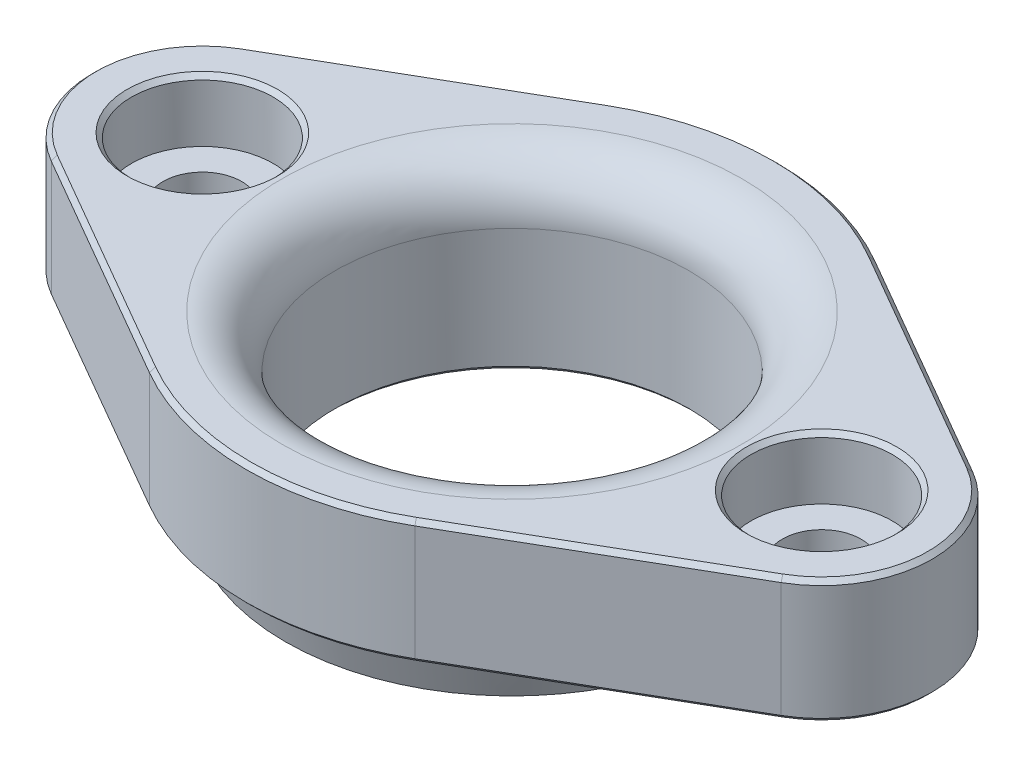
from build123d import *
from OCP.BRepFilletAPI import BRepFilletAPI_MakeChamfer

# Parameters (mm, degrees)
FILLET1_R                                      = 0.508
FILLET2_R                                      = 1.524
CBORE_FOR_2_SOCKET_HEAD_CAP_SCREW1_D           = 2.2606
CBORE_FOR_2_SOCKET_HEAD_CAP_SCREW1_CBORE_D     = 4.064
CBORE_FOR_2_SOCKET_HEAD_CAP_SCREW1_CBORE_DEPTH = 1.778
CIRPATTERN1_COUNT                              = 2
SKETCH5_OUTSIDE_W                              = 33.03
SKETCH5_OUTSIDE_H                              = 33.03
CUT_EXTRUDE1_DEPTH                             = 18.802664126
CHAMFER1_SIZE                                  = 0.127
CHAMFER1_SIZE2                                 = 0.179605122


with BuildPart() as part:
    # Sketch1 → Revolve1 (revolve)
    with BuildSketch(Plane.XY, mode=Mode.PRIVATE) as revolve1_sk:
        Polygon((-5.08, 0), (-5.08, 5.08), (-12.065, 5.08), (-12.065, 1.524), (-6.885354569, 1.524), (-6.477, 0), align=None)
    revolve(revolve1_sk.sketch.rotate(Axis((0, 0, 0), (0, 1, 0)), 270), axis=Axis((0, 0, 0), (0, 1, 0)))

    # Fillet1
    fillet1_edges = [part.edges().sort_by_distance(p)[0] for p in [
        (0, 1.524, 6.885354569),
    ]]
    fillet(fillet1_edges, radius=FILLET1_R)

    # Fillet2
    fillet2_edges = [part.edges().sort_by_distance(p)[0] for p in [
        (0, 5.08, 5.08),
    ]]
    fillet(fillet2_edges, radius=FILLET2_R)

    # CBORE for _2 Socket Head Cap Screw1 (through all)
    with Locations(Plane(origin=(0, 5.08, 0), x_dir=(1, 0, 0), z_dir=(0, 1, 0))):
        with Locations((-8.89, 0)):
            cbore_for_2_socket_head_cap_screw1 = CounterBoreHole(CBORE_FOR_2_SOCKET_HEAD_CAP_SCREW1_D / 2, CBORE_FOR_2_SOCKET_HEAD_CAP_SCREW1_CBORE_D / 2, CBORE_FOR_2_SOCKET_HEAD_CAP_SCREW1_CBORE_DEPTH)

    # CirPattern1: CBORE for _2 Socket Head Cap Screw1 ×2 about axis
    cirpattern1_axis = Axis((0, 0, 0), (0, 1, 0))
    for i in range(1, CIRPATTERN1_COUNT):
        add(cbore_for_2_socket_head_cap_screw1.rotate(cirpattern1_axis, i * 360 / CIRPATTERN1_COUNT), mode=Mode.SUBTRACT)

    # Sketch5 outside → Cut-Extrude1 (cut, through all)
    with BuildSketch(Plane(origin=(0, 5.08, 0), x_dir=(1, 0, 0), z_dir=(0, 1, 0))):
        Rectangle(SKETCH5_OUTSIDE_W, SKETCH5_OUTSIDE_H)
        with BuildLine():
            Line((-10.4775, -2.749630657), (-3.81, -6.599113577))
            ThreePointArc((-3.81, -6.599113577), (0, -7.62), (3.81, -6.599113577))
            Line((3.81, -6.599113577), (10.4775, -2.749630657))
            ThreePointArc((10.4775, -2.749630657), (12.065, 0), (10.4775, 2.749630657))
            Line((10.4775, 2.749630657), (3.81, 6.599113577))
            ThreePointArc((3.81, 6.599113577), (0, 7.62), (-3.81, 6.599113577))
            Line((-3.81, 6.599113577), (-10.4775, 2.749630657))
            ThreePointArc((-10.4775, 2.749630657), (-12.065, 0), (-10.4775, -2.749630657))
        make_face(mode=Mode.SUBTRACT)
    extrude(amount=-CUT_EXTRUDE1_DEPTH, mode=Mode.SUBTRACT)

    # Chamfer1: one chamfer whose edges measure the first distance from different faces: ONE call of the kernel's chamfer builder (chamfer() names one face for all edges)
    chamfer1_edges_1 = [part.edges().sort_by_distance(p)[0] for p in [
        (-7.7597, 1.524, 0),
        (-10.922, 5.08, 0),
        (7.7597, 1.524, 0),
        (10.922, 5.08, 0),
        (7.14375, 1.524, -4.674372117),
        (0, 1.524, -7.62),
        (-7.14375, 1.524, -4.674372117),
        (-12.065, 1.524, 0),
        (12.065, 1.524, 0),
        (-7.14375, 1.524, 4.674372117),
        (0, 1.524, 7.62),
        (7.14375, 1.524, 4.674372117),
        (12.065, 5.08, 0),
        (7.14375, 5.08, 4.674372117),
        (0, 5.08, 7.62),
        (-7.14375, 5.08, 4.674372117),
        (-12.065, 5.08, 0),
        (-7.14375, 5.08, -4.674372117),
        (0, 5.08, -7.62),
        (7.14375, 5.08, -4.674372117),
        (0, 0, 5.08),
    ]]
    chamfer1_edges_2 = [part.edges().sort_by_distance(p)[0] for p in [
        (0, 0, 6.477),
    ]]
    chamfer1_side_2 = [part.faces().sort_by_distance(p)[0] for p in [
        (0, 0.573740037, 6.63073318),
    ]]
    chamfer1 = BRepFilletAPI_MakeChamfer(part.part.solid().wrapped)
    for e in chamfer1_edges_1:
        chamfer1.Add(CHAMFER1_SIZE, e.wrapped)
    for e in chamfer1_edges_2:
        chamfer1.Add(CHAMFER1_SIZE, CHAMFER1_SIZE2, e.wrapped, chamfer1_side_2[0].wrapped)  # the first distance lies on this face
    add(Compound.cast(chamfer1.Shape()), mode=Mode.REPLACE)


solid = part.part
